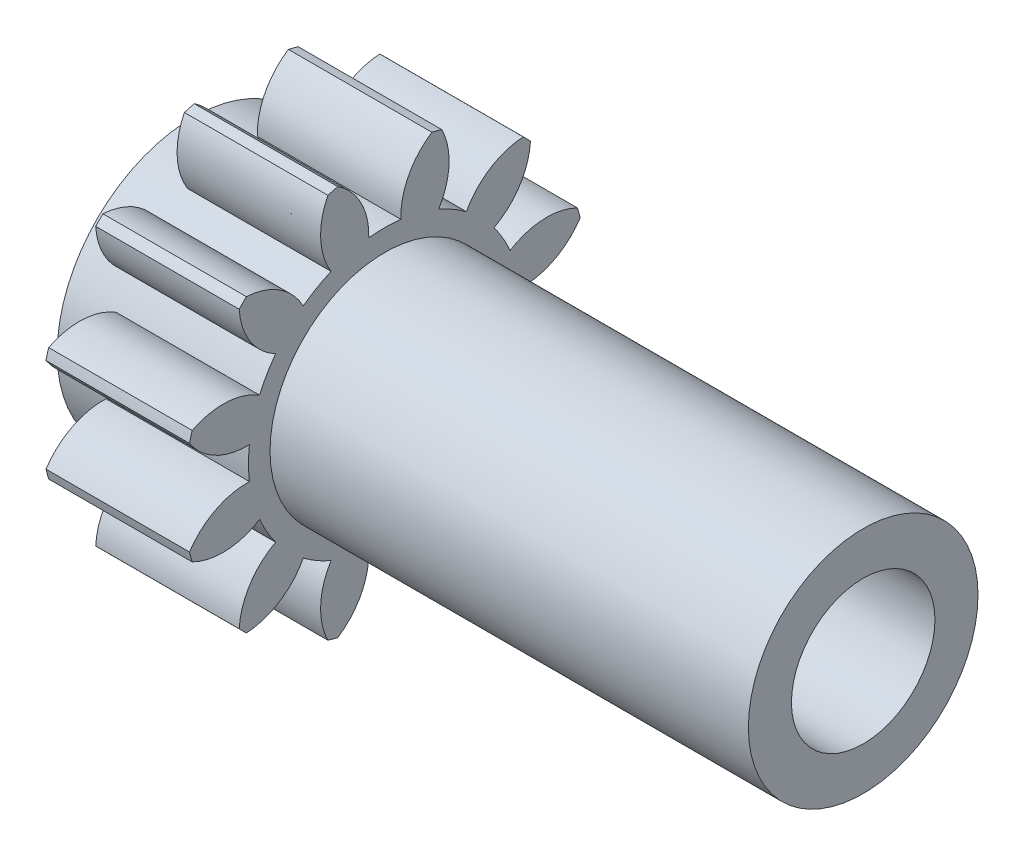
from build123d import *
from build123d.topology import SkipClean

# Parameters (mm, degrees)
BASPROSKE_W             = 15
BASPROSKE_H             = 21
TOOTHCUT_DEPTH          = 34.271609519
TEETHCUTS_COUNT         = 12
TEETHCUTS_ANGLE         = 330
HUBNEARONE_START        = 35.0000508
HUBNEAONESKE_R          = 14.249
HUBNEARONE_DEPTH        = 35.0000508
BORSKE_R                = 7.5
BORE_DEPTH              = 50.0000508
ESQUISSE1_R             = 14.249
ENL_V_MAT_EXTRU_1_DEPTH = 30
BOSS_EXTRU_1_START      = 50
ESQUISSE2_R             = 12
ESQUISSE2_R_2           = 7.5
BOSS_EXTRU_1_DEPTH      = 50


with BuildPart() as part:
    # BasProSke → Base-Revolve (revolve)
    with BuildSketch(Plane(origin=(0, 0, 0), x_dir=(1, 0, 0), z_dir=(0, 1, 0)), mode=Mode.PRIVATE) as base_revolve_sk:
        with Locations((7.5, 10.5)):
            Rectangle(BASPROSKE_W, BASPROSKE_H)
    revolve(base_revolve_sk.sketch.rotate(Axis((-10, 0, 0), (1, 0, 0)), 180), axis=Axis((-10, 0, 0), (1, 0, 0)))

    # TooCutSke → ToothCut (cut, through all)
    with BuildSketch(Plane(origin=(0, 0, 0), x_dir=(0, 0, -1), z_dir=(1, 0, 0))):
        with BuildLine():
            ThreePointArc((1.676853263, 14.149988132), (0, 14.249), (-1.676853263, 14.149988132))
            ThreePointArc((-1.676853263, 14.149988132), (-2.484641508, 17.722586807), (-4.945579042, 20.435476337))
            ThreePointArc((-4.945579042, 20.435476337), (0, 21.0254), (4.945579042, 20.435476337))
            ThreePointArc((4.945579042, 20.435476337), (2.484641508, 17.722586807), (1.676853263, 14.149988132))
        make_face()
    toothcut = extrude(amount=TOOTHCUT_DEPTH, mode=Mode.SUBTRACT)

    # TeethCuts: ToothCut ×12 about axis
    teethcuts_axis = Axis((-10, 0, 0), (1, 0, 0))
    for i in range(1, TEETHCUTS_COUNT):
        add(toothcut.rotate(teethcuts_axis, i * TEETHCUTS_ANGLE / (TEETHCUTS_COUNT - 1)), mode=Mode.SUBTRACT)

    # HubNeaOneSke → HubNearOne (add)
    with SkipClean():  # the faces are left unmerged after this step: merging them gives an invalid solid
        with BuildSketch(Plane.ZY.offset(HUBNEARONE_START)):
            Circle(HUBNEAONESKE_R)
        extrude(amount=-HUBNEARONE_DEPTH)

    # BorSke → Bore (cut, symmetric)
    with SkipClean():  # the faces are left unmerged after this step: merging them gives an invalid solid
        with BuildSketch(Plane(origin=(0, 0, 0), x_dir=(0, 0, -1), z_dir=(1, 0, 0))):
            with Locations(Location((0, 0, 0), (0, 0, 180))):
                Circle(BORSKE_R)
        extrude(amount=BORE_DEPTH, both=True, mode=Mode.SUBTRACT)

    # Esquisse1 → Enl_v. mat.-Extru.1 (cut)
    with SkipClean():  # the faces are left unmerged after this step: merging them gives an invalid solid
        with BuildSketch(Plane.ZY.offset(35.0000508)):
            Circle(ESQUISSE1_R)
        extrude(amount=-ENL_V_MAT_EXTRU_1_DEPTH, mode=Mode.SUBTRACT)

    # Esquisse2 → Boss.-Extru.1 (add)
    with SkipClean():  # the faces are left unmerged after this step: merging them gives an invalid solid
        with BuildSketch(Plane(origin=(15, 0, 0), x_dir=(0, 0, -1), z_dir=(1, 0, 0)).offset(BOSS_EXTRU_1_START)):
            with Locations(Location((0, 0, 0), (0, 0, 180))):
                Circle(ESQUISSE2_R)
            with Locations(Location((0, 0, 0), (0, 0, 180))):
                Circle(ESQUISSE2_R_2, mode=Mode.SUBTRACT)
        extrude(amount=-BOSS_EXTRU_1_DEPTH)


solid = part.part
